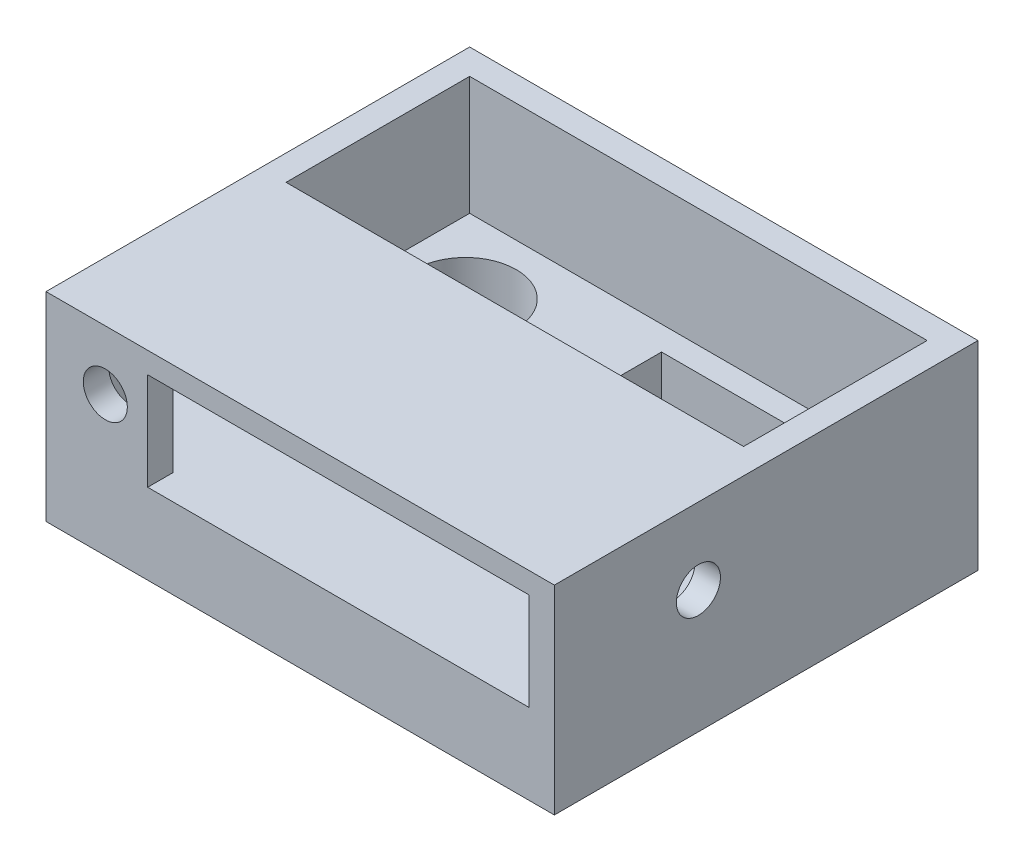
from build123d import *

# Parameters (mm, degrees)
ESQUISSE1_W             = 60
ESQUISSE1_H             = 50
BOSS_EXTRU_1_DEPTH      = 21
ESQUISSE2_W             = 54
ESQUISSE2_H             = 44
ENL_V_MAT_EXTRU_1_DEPTH = 14
ENL_V_MAT_EXTRU_2_REACH = 81.347
ESQUISSE3_W             = 23
ESQUISSE3_H             = 12.3
ESQUISSE4_R             = 2.6
ENL_V_MAT_EXTRU_3_DEPTH = 10
ESQUISSE5_W             = 60
ESQUISSE5_H             = 50
ESQUISSE5_W_2           = 33
ESQUISSE5_H_2           = 12.3
BOSS_EXTRU_2_DEPTH      = 2.5
ESQUISSE6_R             = 2.6
ENL_V_MAT_EXTRU_4_DEPTH = 10
ESQUISSE8_W             = 60
ESQUISSE8_H             = 25.332095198
BOSS_EXTRU_3_DEPTH      = 2.5
ESQUISSE9_W             = 45
ESQUISSE9_H             = 11.5
ENL_V_MAT_EXTRU_6_DEPTH = 3
ESQUISSE10_R            = 6
ENL_V_MAT_EXTRU_7_DEPTH = 9.5


with BuildPart() as part:
    # Esquisse1 → Boss.-Extru.1 (new body)
    with BuildSketch(Plane(origin=(0, 0, 0), x_dir=(1, 0, 0), z_dir=(0, 1, 0))):
        with Locations((30, -25)):
            Rectangle(ESQUISSE1_W, ESQUISSE1_H)
    extrude(amount=BOSS_EXTRU_1_DEPTH)

    # Esquisse2 → Enl_v. mat.-Extru.1 (cut)
    with BuildSketch(Plane(origin=(0, 21, 0), x_dir=(1, 0, 0), z_dir=(0, 1, 0))):
        with Locations((30, -25)):
            Rectangle(ESQUISSE2_W, ESQUISSE2_H)
    extrude(amount=-ENL_V_MAT_EXTRU_1_DEPTH, mode=Mode.SUBTRACT)

    # Esquisse3 → Enl_v. mat.-Extru.2 (cut, up to next)
    with BuildSketch(Plane(origin=(0, 7, 0), x_dir=(1, 0, 0), z_dir=(0, 1, 0)), mode=Mode.PRIVATE) as enl_v_mat_extru_2_sk1:
        with Locations((40, -12)):
            Rectangle(ESQUISSE3_W, ESQUISSE3_H)
    enl_v_mat_extru_2_tool1 = extrude(enl_v_mat_extru_2_sk1.sketch, amount=-ENL_V_MAT_EXTRU_2_REACH, mode=Mode.PRIVATE) & part.part
    add(enl_v_mat_extru_2_tool1.solids().sort_by_distance((40, 7, 12))[0], mode=Mode.SUBTRACT)

    # Esquisse4 → Enl_v. mat.-Extru.3 (cut)
    with BuildSketch(Plane(origin=(60, 0, 0), x_dir=(0, 0, -1), z_dir=(1, 0, 0))):
        with Locations((-33, 12)):
            Circle(ESQUISSE4_R)
    extrude(amount=-ENL_V_MAT_EXTRU_3_DEPTH, mode=Mode.SUBTRACT)

    # Esquisse5 → Boss.-Extru.2 (add)
    with BuildSketch(Plane.XZ):
        with Locations((30, 25)):
            Rectangle(ESQUISSE5_W, ESQUISSE5_H)
        with Locations((40, 12)):
            Rectangle(ESQUISSE5_W_2, ESQUISSE5_H_2, mode=Mode.SUBTRACT)
    extrude(amount=BOSS_EXTRU_2_DEPTH)

    # Esquisse6 → Enl_v. mat.-Extru.4 (cut)
    with BuildSketch(Plane.XY.offset(50)):
        with Locations((7, 14)):
            Circle(ESQUISSE6_R)
    extrude(amount=-ENL_V_MAT_EXTRU_4_DEPTH, mode=Mode.SUBTRACT)

    # Esquisse8 → Boss.-Extru.3 (add)
    with BuildSketch(Plane(origin=(0, 21, 0), x_dir=(1, 0, 0), z_dir=(0, 1, 0))):
        with Locations((30, -37.333952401)):
            Rectangle(ESQUISSE8_W, ESQUISSE8_H)
    extrude(amount=-BOSS_EXTRU_3_DEPTH)

    # Esquisse9 → Enl_v. mat.-Extru.6 (cut)
    with BuildSketch(Plane.XY.offset(50)):
        with Locations((34.5, 12.75)):
            Rectangle(ESQUISSE9_W, ESQUISSE9_H)
    extrude(amount=-ENL_V_MAT_EXTRU_6_DEPTH, mode=Mode.SUBTRACT)

    # Esquisse10 → Enl_v. mat.-Extru.7 (cut)
    with BuildSketch(Plane(origin=(0, -2.5, 0), x_dir=(-1, 0, 0), z_dir=(0, -1, 0))):
        with Locations(Location((-11.5, -12, 0), (0, 0, 90))):
            Circle(ESQUISSE10_R)
    extrude(amount=-ENL_V_MAT_EXTRU_7_DEPTH, mode=Mode.SUBTRACT)


solid = part.part
